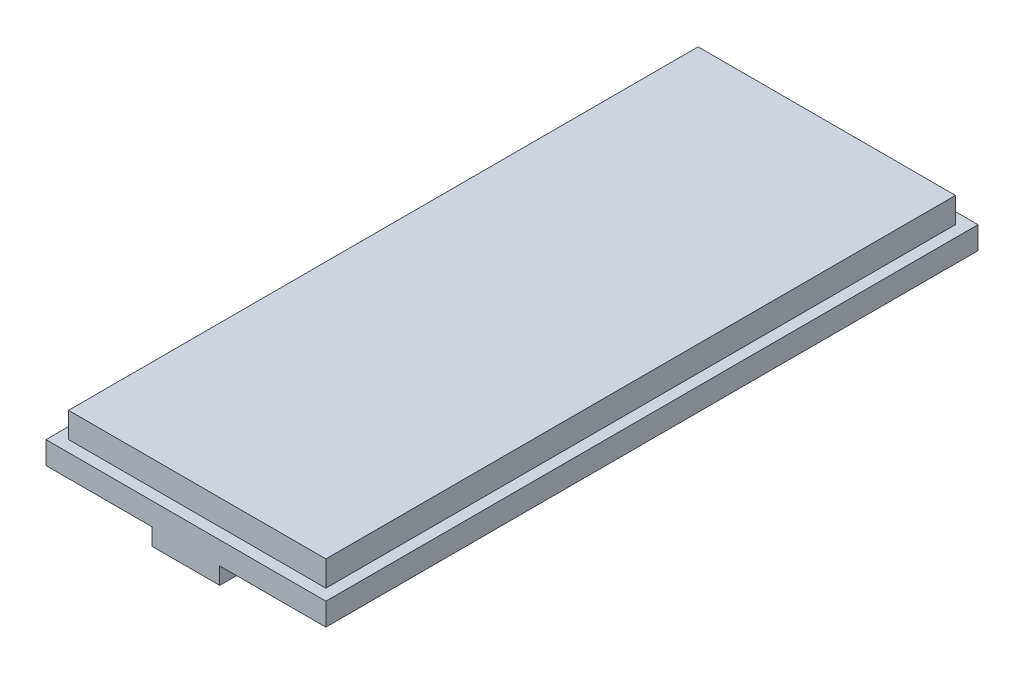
ISO-10303-21;
HEADER;
FILE_DESCRIPTION(('STEP AP214'),'2;1');
FILE_NAME('part.step','',(''),(''),'','','');
FILE_SCHEMA(('AUTOMOTIVE_DESIGN { 1 0 10303 214 1 1 1 1 }'));
ENDSEC;
DATA;
#1=APPLICATION_CONTEXT('core data for automotive mechanical design processes');
#2=APPLICATION_PROTOCOL_DEFINITION('international standard','automotive_design',2000,#1);
#3=PRODUCT_CONTEXT('',#1,'mechanical');
#4=PRODUCT('Part','Part','',(#3));
#5=PRODUCT_RELATED_PRODUCT_CATEGORY('part','',(#4));
#6=PRODUCT_DEFINITION_FORMATION('','',#4);
#7=PRODUCT_DEFINITION_CONTEXT('part definition',#1,'design');
#8=PRODUCT_DEFINITION('design','',#6,#7);
#9=PRODUCT_DEFINITION_SHAPE('','',#8);
#10=(LENGTH_UNIT() NAMED_UNIT(*) SI_UNIT(.MILLI.,.METRE.));
#11=(NAMED_UNIT(*) PLANE_ANGLE_UNIT() SI_UNIT($,.RADIAN.));
#12=(NAMED_UNIT(*) SI_UNIT($,.STERADIAN.) SOLID_ANGLE_UNIT());
#13=UNCERTAINTY_MEASURE_WITH_UNIT(LENGTH_MEASURE(1.E-05),#10,'distance_accuracy_value','');
#14=(GEOMETRIC_REPRESENTATION_CONTEXT(3) GLOBAL_UNCERTAINTY_ASSIGNED_CONTEXT((#13)) GLOBAL_UNIT_ASSIGNED_CONTEXT((#10,
#11,#12)) REPRESENTATION_CONTEXT('',''));
#15=CARTESIAN_POINT('',(0.,0.,0.));
#16=DIRECTION('',(0.,0.,1.));
#17=DIRECTION('',(1.,0.,0.));
#18=AXIS2_PLACEMENT_3D('',#15,#16,#17);
#19=CARTESIAN_POINT('',(-19.9999999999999,-40.,-20.));
#20=DIRECTION('',(0.,-1.,0.));
#21=DIRECTION('',(0.,0.,-1.));
#22=AXIS2_PLACEMENT_3D('',#19,#20,#21);
#23=PLANE('',#22);
#24=DIRECTION('',(0.,0.,-1.));
#25=VECTOR('',#24,1.);
#26=CARTESIAN_POINT('',(168.5,-40.,1138.));
#27=LINE('',#26,#25);
#28=CARTESIAN_POINT('',(168.5,-40.,1138.));
#29=VERTEX_POINT('',#28);
#30=CARTESIAN_POINT('',(168.5,-40.,-20.));
#31=VERTEX_POINT('',#30);
#32=EDGE_CURVE('E44',#29,#31,#27,.T.);
#33=ORIENTED_EDGE('',*,*,#32,.F.);
#34=DIRECTION('',(-1.,0.,0.));
#35=VECTOR('',#34,1.);
#36=CARTESIAN_POINT('',(-20.,-40.,1138.));
#37=LINE('',#36,#35);
#38=CARTESIAN_POINT('',(-20.,-40.,1138.));
#39=VERTEX_POINT('',#38);
#40=EDGE_CURVE('E125',#29,#39,#37,.T.);
#41=ORIENTED_EDGE('',*,*,#40,.T.);
#42=DIRECTION('',(0.,0.,-1.));
#43=VECTOR('',#42,1.);
#44=CARTESIAN_POINT('',(-20.,-40.,1138.));
#45=LINE('',#44,#43);
#46=CARTESIAN_POINT('',(-19.9999999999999,-40.,-20.));
#47=VERTEX_POINT('',#46);
#48=EDGE_CURVE('E177',#39,#47,#45,.T.);
#49=ORIENTED_EDGE('',*,*,#48,.T.);
#50=DIRECTION('',(1.,0.,0.));
#51=VECTOR('',#50,1.);
#52=CARTESIAN_POINT('',(-19.9999999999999,-40.,-20.));
#53=LINE('',#52,#51);
#54=EDGE_CURVE('E187',#47,#31,#53,.T.);
#55=ORIENTED_EDGE('',*,*,#54,.T.);
#56=EDGE_LOOP('',(#33,#41,#49,#55));
#57=FACE_BOUND('',#56,.T.);
#58=ADVANCED_FACE('F27',(#57),#23,.T.);
#59=CARTESIAN_POINT('',(0.,45.,1118.));
#60=DIRECTION('',(1.,0.,0.));
#61=DIRECTION('',(0.,1.,0.));
#62=AXIS2_PLACEMENT_3D('',#59,#60,#61);
#63=PLANE('',#62);
#64=DIRECTION('',(0.,-1.,0.));
#65=VECTOR('',#64,1.);
#66=CARTESIAN_POINT('',(0.,45.,0.));
#67=LINE('',#66,#65);
#68=CARTESIAN_POINT('',(0.,45.,0.));
#69=VERTEX_POINT('',#68);
#70=CARTESIAN_POINT('',(0.,0.,0.));
#71=VERTEX_POINT('',#70);
#72=EDGE_CURVE('E212',#69,#71,#67,.T.);
#73=ORIENTED_EDGE('',*,*,#72,.T.);
#74=DIRECTION('',(0.,0.,-1.));
#75=VECTOR('',#74,1.);
#76=CARTESIAN_POINT('',(0.,0.,1118.));
#77=LINE('',#76,#75);
#78=CARTESIAN_POINT('',(0.,0.,1118.));
#79=VERTEX_POINT('',#78);
#80=EDGE_CURVE('E11',#79,#71,#77,.T.);
#81=ORIENTED_EDGE('',*,*,#80,.F.);
#82=DIRECTION('',(0.,-1.,0.));
#83=VECTOR('',#82,1.);
#84=CARTESIAN_POINT('',(0.,45.,1118.));
#85=LINE('',#84,#83);
#86=CARTESIAN_POINT('',(0.,45.,1118.));
#87=VERTEX_POINT('',#86);
#88=EDGE_CURVE('E203',#87,#79,#85,.T.);
#89=ORIENTED_EDGE('',*,*,#88,.F.);
#90=DIRECTION('',(0.,0.,-1.));
#91=VECTOR('',#90,1.);
#92=CARTESIAN_POINT('',(0.,45.,1118.));
#93=LINE('',#92,#91);
#94=EDGE_CURVE('E194',#87,#69,#93,.T.);
#95=ORIENTED_EDGE('',*,*,#94,.T.);
#96=EDGE_LOOP('',(#73,#81,#89,#95));
#97=FACE_BOUND('',#96,.T.);
#98=ADVANCED_FACE('F29',(#97),#63,.F.);
#99=CARTESIAN_POINT('',(457.,0.,1118.));
#100=DIRECTION('',(-1.,0.,0.));
#101=DIRECTION('',(0.,0.,1.));
#102=AXIS2_PLACEMENT_3D('',#99,#100,#101);
#103=PLANE('',#102);
#104=DIRECTION('',(0.,1.,0.));
#105=VECTOR('',#104,1.);
#106=CARTESIAN_POINT('',(457.,0.,0.));
#107=LINE('',#106,#105);
#108=CARTESIAN_POINT('',(457.,0.,0.));
#109=VERTEX_POINT('',#108);
#110=CARTESIAN_POINT('',(457.,45.0000000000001,0.));
#111=VERTEX_POINT('',#110);
#112=EDGE_CURVE('E207',#109,#111,#107,.T.);
#113=ORIENTED_EDGE('',*,*,#112,.T.);
#114=DIRECTION('',(0.,0.,-1.));
#115=VECTOR('',#114,1.);
#116=CARTESIAN_POINT('',(457.,45.0000000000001,1118.));
#117=LINE('',#116,#115);
#118=CARTESIAN_POINT('',(457.,45.0000000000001,1118.));
#119=VERTEX_POINT('',#118);
#120=EDGE_CURVE('E191',#119,#111,#117,.T.);
#121=ORIENTED_EDGE('',*,*,#120,.F.);
#122=DIRECTION('',(0.,1.,0.));
#123=VECTOR('',#122,1.);
#124=CARTESIAN_POINT('',(457.,0.,1118.));
#125=LINE('',#124,#123);
#126=CARTESIAN_POINT('',(457.,0.,1118.));
#127=VERTEX_POINT('',#126);
#128=EDGE_CURVE('E199',#127,#119,#125,.T.);
#129=ORIENTED_EDGE('',*,*,#128,.F.);
#130=DIRECTION('',(0.,0.,-1.));
#131=VECTOR('',#130,1.);
#132=CARTESIAN_POINT('',(457.,0.,1118.));
#133=LINE('',#132,#131);
#134=EDGE_CURVE('E36',#127,#109,#133,.T.);
#135=ORIENTED_EDGE('',*,*,#134,.T.);
#136=EDGE_LOOP('',(#113,#121,#129,#135));
#137=FACE_BOUND('',#136,.T.);
#138=ADVANCED_FACE('F263',(#137),#103,.F.);
#139=CARTESIAN_POINT('',(457.,45.0000000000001,1118.));
#140=DIRECTION('',(0.,-1.,0.));
#141=DIRECTION('',(1.,0.,0.));
#142=AXIS2_PLACEMENT_3D('',#139,#140,#141);
#143=PLANE('',#142);
#144=DIRECTION('',(-1.,0.,0.));
#145=VECTOR('',#144,1.);
#146=CARTESIAN_POINT('',(457.,45.0000000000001,0.));
#147=LINE('',#146,#145);
#148=EDGE_CURVE('E205',#111,#69,#147,.T.);
#149=ORIENTED_EDGE('',*,*,#148,.T.);
#150=ORIENTED_EDGE('',*,*,#94,.F.);
#151=DIRECTION('',(-1.,0.,0.));
#152=VECTOR('',#151,1.);
#153=CARTESIAN_POINT('',(457.,45.0000000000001,1118.));
#154=LINE('',#153,#152);
#155=EDGE_CURVE('E197',#119,#87,#154,.T.);
#156=ORIENTED_EDGE('',*,*,#155,.F.);
#157=ORIENTED_EDGE('',*,*,#120,.T.);
#158=EDGE_LOOP('',(#149,#150,#156,#157));
#159=FACE_BOUND('',#158,.T.);
#160=ADVANCED_FACE('F279',(#159),#143,.F.);
#161=CARTESIAN_POINT('',(0.,0.,1118.));
#162=DIRECTION('',(0.,0.,1.));
#163=DIRECTION('',(1.,0.,0.));
#164=AXIS2_PLACEMENT_3D('',#161,#162,#163);
#165=PLANE('',#164);
#166=ORIENTED_EDGE('',*,*,#88,.T.);
#167=DIRECTION('',(1.,0.,0.));
#168=VECTOR('',#167,1.);
#169=CARTESIAN_POINT('',(0.,0.,1118.));
#170=LINE('',#169,#168);
#171=EDGE_CURVE('E201',#79,#127,#170,.T.);
#172=ORIENTED_EDGE('',*,*,#171,.T.);
#173=ORIENTED_EDGE('',*,*,#128,.T.);
#174=ORIENTED_EDGE('',*,*,#155,.T.);
#175=EDGE_LOOP('',(#166,#172,#173,#174));
#176=FACE_BOUND('',#175,.T.);
#177=ADVANCED_FACE('F275',(#176),#165,.T.);
#178=CARTESIAN_POINT('',(0.,0.,0.));
#179=DIRECTION('',(0.,0.,1.));
#180=DIRECTION('',(1.,0.,0.));
#181=AXIS2_PLACEMENT_3D('',#178,#179,#180);
#182=PLANE('',#181);
#183=ORIENTED_EDGE('',*,*,#72,.F.);
#184=ORIENTED_EDGE('',*,*,#148,.F.);
#185=ORIENTED_EDGE('',*,*,#112,.F.);
#186=DIRECTION('',(1.,0.,0.));
#187=VECTOR('',#186,1.);
#188=CARTESIAN_POINT('',(0.,0.,0.));
#189=LINE('',#188,#187);
#190=EDGE_CURVE('E209',#71,#109,#189,.T.);
#191=ORIENTED_EDGE('',*,*,#190,.F.);
#192=EDGE_LOOP('',(#183,#184,#185,#191));
#193=FACE_BOUND('',#192,.T.);
#194=ADVANCED_FACE('F272',(#193),#182,.F.);
#195=CARTESIAN_POINT('',(-20.,-40.,1138.));
#196=DIRECTION('',(1.,0.,0.));
#197=DIRECTION('',(0.,0.,-1.));
#198=AXIS2_PLACEMENT_3D('',#195,#196,#197);
#199=PLANE('',#198);
#200=DIRECTION('',(0.,0.,-1.));
#201=VECTOR('',#200,1.);
#202=CARTESIAN_POINT('',(-20.,0.,1138.));
#203=LINE('',#202,#201);
#204=CARTESIAN_POINT('',(-20.,0.,1138.));
#205=VERTEX_POINT('',#204);
#206=CARTESIAN_POINT('',(-19.9999999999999,0.,-20.));
#207=VERTEX_POINT('',#206);
#208=EDGE_CURVE('E155',#205,#207,#203,.T.);
#209=ORIENTED_EDGE('',*,*,#208,.T.);
#210=DIRECTION('',(0.,1.,0.));
#211=VECTOR('',#210,1.);
#212=CARTESIAN_POINT('',(-19.9999999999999,-40.,-20.));
#213=LINE('',#212,#211);
#214=EDGE_CURVE('E215',#47,#207,#213,.T.);
#215=ORIENTED_EDGE('',*,*,#214,.F.);
#216=ORIENTED_EDGE('',*,*,#48,.F.);
#217=DIRECTION('',(0.,1.,0.));
#218=VECTOR('',#217,1.);
#219=CARTESIAN_POINT('',(-20.,-40.,1138.));
#220=LINE('',#219,#218);
#221=EDGE_CURVE('E124',#39,#205,#220,.T.);
#222=ORIENTED_EDGE('',*,*,#221,.T.);
#223=EDGE_LOOP('',(#209,#215,#216,#222));
#224=FACE_BOUND('',#223,.T.);
#225=ADVANCED_FACE('F232',(#224),#199,.F.);
#226=CARTESIAN_POINT('',(-19.9999999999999,-40.,-20.));
#227=DIRECTION('',(0.,0.,1.));
#228=DIRECTION('',(1.,0.,0.));
#229=AXIS2_PLACEMENT_3D('',#226,#227,#228);
#230=PLANE('',#229);
#231=DIRECTION('',(1.,0.,0.));
#232=VECTOR('',#231,1.);
#233=CARTESIAN_POINT('',(-19.9999999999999,0.,-20.));
#234=LINE('',#233,#232);
#235=CARTESIAN_POINT('',(477.,0.,-20.));
#236=VERTEX_POINT('',#235);
#237=EDGE_CURVE('E171',#207,#236,#234,.T.);
#238=ORIENTED_EDGE('',*,*,#237,.T.);
#239=DIRECTION('',(0.,1.,0.));
#240=VECTOR('',#239,1.);
#241=CARTESIAN_POINT('',(477.,-40.,-20.));
#242=LINE('',#241,#240);
#243=CARTESIAN_POINT('',(477.,-40.,-20.));
#244=VERTEX_POINT('',#243);
#245=EDGE_CURVE('E218',#244,#236,#242,.T.);
#246=ORIENTED_EDGE('',*,*,#245,.F.);
#247=CARTESIAN_POINT('',(288.5,-40.,-20.));
#248=VERTEX_POINT('',#247);
#249=EDGE_CURVE('E180',#248,#244,#53,.T.);
#250=ORIENTED_EDGE('',*,*,#249,.F.);
#251=DIRECTION('',(0.,1.,0.));
#252=VECTOR('',#251,1.);
#253=CARTESIAN_POINT('',(288.5,-70.,-20.));
#254=LINE('',#253,#252);
#255=CARTESIAN_POINT('',(288.5,-70.,-20.));
#256=VERTEX_POINT('',#255);
#257=EDGE_CURVE('E135',#256,#248,#254,.T.);
#258=ORIENTED_EDGE('',*,*,#257,.F.);
#259=DIRECTION('',(1.,0.,0.));
#260=VECTOR('',#259,1.);
#261=CARTESIAN_POINT('',(168.5,-70.,-20.));
#262=LINE('',#261,#260);
#263=CARTESIAN_POINT('',(168.5,-70.,-20.));
#264=VERTEX_POINT('',#263);
#265=EDGE_CURVE('E164',#264,#256,#262,.T.);
#266=ORIENTED_EDGE('',*,*,#265,.F.);
#267=DIRECTION('',(0.,1.,0.));
#268=VECTOR('',#267,1.);
#269=CARTESIAN_POINT('',(168.5,-70.,-20.));
#270=LINE('',#269,#268);
#271=EDGE_CURVE('E143',#264,#31,#270,.T.);
#272=ORIENTED_EDGE('',*,*,#271,.T.);
#273=ORIENTED_EDGE('',*,*,#54,.F.);
#274=ORIENTED_EDGE('',*,*,#214,.T.);
#275=EDGE_LOOP('',(#238,#246,#250,#258,#266,#272,#273,#274));
#276=FACE_BOUND('',#275,.T.);
#277=ADVANCED_FACE('F234',(#276),#230,.F.);
#278=CARTESIAN_POINT('',(477.,-40.,1138.));
#279=DIRECTION('',(-1.,0.,0.));
#280=DIRECTION('',(0.,0.,1.));
#281=AXIS2_PLACEMENT_3D('',#278,#279,#280);
#282=PLANE('',#281);
#283=DIRECTION('',(0.,0.,1.));
#284=VECTOR('',#283,1.);
#285=CARTESIAN_POINT('',(477.,0.,1138.));
#286=LINE('',#285,#284);
#287=CARTESIAN_POINT('',(477.,0.,1138.));
#288=VERTEX_POINT('',#287);
#289=EDGE_CURVE('E173',#236,#288,#286,.T.);
#290=ORIENTED_EDGE('',*,*,#289,.T.);
#291=DIRECTION('',(0.,1.,0.));
#292=VECTOR('',#291,1.);
#293=CARTESIAN_POINT('',(477.,-40.,1138.));
#294=LINE('',#293,#292);
#295=CARTESIAN_POINT('',(477.,-40.,1138.));
#296=VERTEX_POINT('',#295);
#297=EDGE_CURVE('E221',#296,#288,#294,.T.);
#298=ORIENTED_EDGE('',*,*,#297,.F.);
#299=DIRECTION('',(0.,0.,1.));
#300=VECTOR('',#299,1.);
#301=CARTESIAN_POINT('',(477.,-40.,1138.));
#302=LINE('',#301,#300);
#303=EDGE_CURVE('E119',#244,#296,#302,.T.);
#304=ORIENTED_EDGE('',*,*,#303,.F.);
#305=ORIENTED_EDGE('',*,*,#245,.T.);
#306=EDGE_LOOP('',(#290,#298,#304,#305));
#307=FACE_BOUND('',#306,.T.);
#308=ADVANCED_FACE('F244',(#307),#282,.F.);
#309=CARTESIAN_POINT('',(-20.,-40.,1138.));
#310=DIRECTION('',(0.,0.,-1.));
#311=DIRECTION('',(-1.,0.,0.));
#312=AXIS2_PLACEMENT_3D('',#309,#310,#311);
#313=PLANE('',#312);
#314=DIRECTION('',(-1.,0.,0.));
#315=VECTOR('',#314,1.);
#316=CARTESIAN_POINT('',(-20.,0.,1138.));
#317=LINE('',#316,#315);
#318=EDGE_CURVE('E175',#288,#205,#317,.T.);
#319=ORIENTED_EDGE('',*,*,#318,.T.);
#320=ORIENTED_EDGE('',*,*,#221,.F.);
#321=ORIENTED_EDGE('',*,*,#40,.F.);
#322=DIRECTION('',(0.,1.,0.));
#323=VECTOR('',#322,1.);
#324=CARTESIAN_POINT('',(168.5,-70.,1138.));
#325=LINE('',#324,#323);
#326=CARTESIAN_POINT('',(168.5,-70.,1138.));
#327=VERTEX_POINT('',#326);
#328=EDGE_CURVE('E141',#327,#29,#325,.T.);
#329=ORIENTED_EDGE('',*,*,#328,.F.);
#330=DIRECTION('',(-1.,0.,0.));
#331=VECTOR('',#330,1.);
#332=CARTESIAN_POINT('',(168.5,-70.,1138.));
#333=LINE('',#332,#331);
#334=CARTESIAN_POINT('',(288.5,-70.,1138.));
#335=VERTEX_POINT('',#334);
#336=EDGE_CURVE('E140',#335,#327,#333,.T.);
#337=ORIENTED_EDGE('',*,*,#336,.F.);
#338=DIRECTION('',(0.,1.,0.));
#339=VECTOR('',#338,1.);
#340=CARTESIAN_POINT('',(288.5,-70.,1138.));
#341=LINE('',#340,#339);
#342=CARTESIAN_POINT('',(288.5,-40.,1138.));
#343=VERTEX_POINT('',#342);
#344=EDGE_CURVE('E132',#335,#343,#341,.T.);
#345=ORIENTED_EDGE('',*,*,#344,.T.);
#346=EDGE_CURVE('E116',#296,#343,#37,.T.);
#347=ORIENTED_EDGE('',*,*,#346,.F.);
#348=ORIENTED_EDGE('',*,*,#297,.T.);
#349=EDGE_LOOP('',(#319,#320,#321,#329,#337,#345,#347,#348));
#350=FACE_BOUND('',#349,.T.);
#351=ADVANCED_FACE('F138',(#350),#313,.F.);
#352=DIRECTION('',(0.,0.,1.));
#353=VECTOR('',#352,1.);
#354=CARTESIAN_POINT('',(288.5,-40.,1138.));
#355=LINE('',#354,#353);
#356=EDGE_CURVE('E52',#248,#343,#355,.T.);
#357=ORIENTED_EDGE('',*,*,#356,.F.);
#358=ORIENTED_EDGE('',*,*,#249,.T.);
#359=ORIENTED_EDGE('',*,*,#303,.T.);
#360=ORIENTED_EDGE('',*,*,#346,.T.);
#361=EDGE_LOOP('',(#357,#358,#359,#360));
#362=FACE_BOUND('',#361,.T.);
#363=ADVANCED_FACE('F117',(#362),#23,.T.);
#364=CARTESIAN_POINT('',(-19.9999999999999,0.,-20.));
#365=DIRECTION('',(0.,-1.,0.));
#366=DIRECTION('',(0.,0.,-1.));
#367=AXIS2_PLACEMENT_3D('',#364,#365,#366);
#368=PLANE('',#367);
#369=ORIENTED_EDGE('',*,*,#171,.F.);
#370=ORIENTED_EDGE('',*,*,#80,.T.);
#371=ORIENTED_EDGE('',*,*,#190,.T.);
#372=ORIENTED_EDGE('',*,*,#134,.F.);
#373=EDGE_LOOP('',(#369,#370,#371,#372));
#374=FACE_BOUND('',#373,.T.);
#375=ORIENTED_EDGE('',*,*,#208,.F.);
#376=ORIENTED_EDGE('',*,*,#318,.F.);
#377=ORIENTED_EDGE('',*,*,#289,.F.);
#378=ORIENTED_EDGE('',*,*,#237,.F.);
#379=EDGE_LOOP('',(#375,#376,#377,#378));
#380=FACE_BOUND('',#379,.T.);
#381=ADVANCED_FACE('F246',(#374,#380),#368,.F.);
#382=CARTESIAN_POINT('',(168.5,-70.,1138.));
#383=DIRECTION('',(1.,0.,0.));
#384=DIRECTION('',(0.,0.,-1.));
#385=AXIS2_PLACEMENT_3D('',#382,#383,#384);
#386=PLANE('',#385);
#387=ORIENTED_EDGE('',*,*,#32,.T.);
#388=ORIENTED_EDGE('',*,*,#271,.F.);
#389=DIRECTION('',(0.,0.,-1.));
#390=VECTOR('',#389,1.);
#391=CARTESIAN_POINT('',(168.5,-70.,1138.));
#392=LINE('',#391,#390);
#393=EDGE_CURVE('E136',#327,#264,#392,.T.);
#394=ORIENTED_EDGE('',*,*,#393,.F.);
#395=ORIENTED_EDGE('',*,*,#328,.T.);
#396=EDGE_LOOP('',(#387,#388,#394,#395));
#397=FACE_BOUND('',#396,.T.);
#398=ADVANCED_FACE('F239',(#397),#386,.F.);
#399=CARTESIAN_POINT('',(288.5,-70.,1138.));
#400=DIRECTION('',(-1.,0.,0.));
#401=DIRECTION('',(0.,0.,1.));
#402=AXIS2_PLACEMENT_3D('',#399,#400,#401);
#403=PLANE('',#402);
#404=ORIENTED_EDGE('',*,*,#356,.T.);
#405=ORIENTED_EDGE('',*,*,#344,.F.);
#406=DIRECTION('',(0.,0.,1.));
#407=VECTOR('',#406,1.);
#408=CARTESIAN_POINT('',(288.5,-70.,1138.));
#409=LINE('',#408,#407);
#410=EDGE_CURVE('E166',#256,#335,#409,.T.);
#411=ORIENTED_EDGE('',*,*,#410,.F.);
#412=ORIENTED_EDGE('',*,*,#257,.T.);
#413=EDGE_LOOP('',(#404,#405,#411,#412));
#414=FACE_BOUND('',#413,.T.);
#415=ADVANCED_FACE('F130',(#414),#403,.F.);
#416=CARTESIAN_POINT('',(168.5,-70.,-20.));
#417=DIRECTION('',(0.,-1.,0.));
#418=DIRECTION('',(0.,0.,-1.));
#419=AXIS2_PLACEMENT_3D('',#416,#417,#418);
#420=PLANE('',#419);
#421=ORIENTED_EDGE('',*,*,#393,.T.);
#422=ORIENTED_EDGE('',*,*,#265,.T.);
#423=ORIENTED_EDGE('',*,*,#410,.T.);
#424=ORIENTED_EDGE('',*,*,#336,.T.);
#425=EDGE_LOOP('',(#421,#422,#423,#424));
#426=FACE_BOUND('',#425,.T.);
#427=ADVANCED_FACE('F241',(#426),#420,.T.);
#428=CLOSED_SHELL('',(#58,#98,#138,#160,#177,#194,#225,#277,#308,#351,#363,#381,#398,#415,#427));
#429=MANIFOLD_SOLID_BREP('B2',#428);
#430=ADVANCED_BREP_SHAPE_REPRESENTATION('',(#18,#429),#14);
#431=SHAPE_DEFINITION_REPRESENTATION(#9,#430);
ENDSEC;
END-ISO-10303-21;
